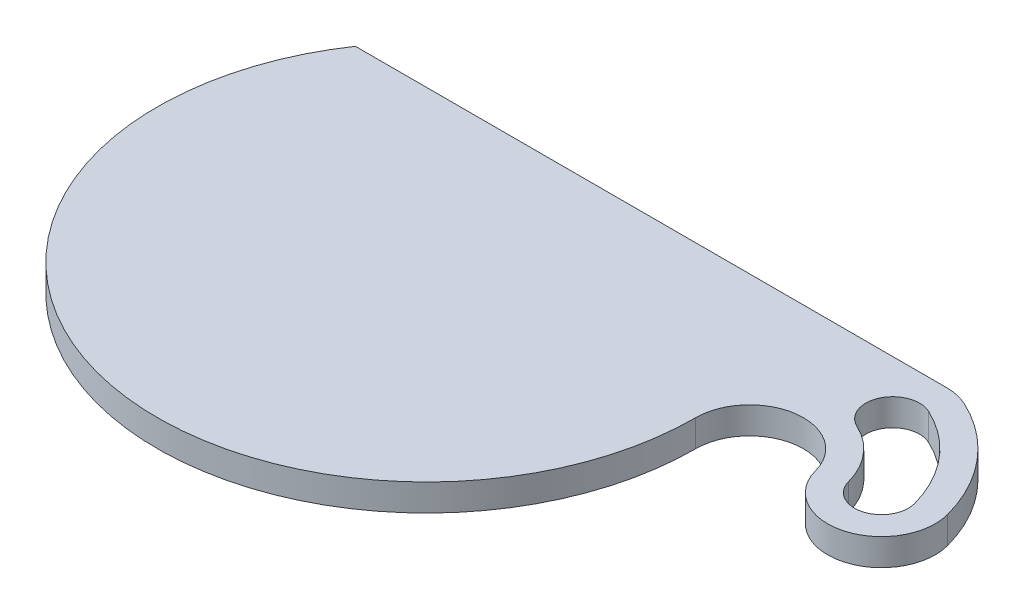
ISO-10303-21;
HEADER;
FILE_DESCRIPTION(('STEP AP214'),'2;1');
FILE_NAME('part.step','',(''),(''),'','','');
FILE_SCHEMA(('AUTOMOTIVE_DESIGN { 1 0 10303 214 1 1 1 1 }'));
ENDSEC;
DATA;
#1=APPLICATION_CONTEXT('core data for automotive mechanical design processes');
#2=APPLICATION_PROTOCOL_DEFINITION('international standard','automotive_design',2000,#1);
#3=PRODUCT_CONTEXT('',#1,'mechanical');
#4=PRODUCT('Part','Part','',(#3));
#5=PRODUCT_RELATED_PRODUCT_CATEGORY('part','',(#4));
#6=PRODUCT_DEFINITION_FORMATION('','',#4);
#7=PRODUCT_DEFINITION_CONTEXT('part definition',#1,'design');
#8=PRODUCT_DEFINITION('design','',#6,#7);
#9=PRODUCT_DEFINITION_SHAPE('','',#8);
#10=(LENGTH_UNIT() NAMED_UNIT(*) SI_UNIT(.MILLI.,.METRE.));
#11=(NAMED_UNIT(*) PLANE_ANGLE_UNIT() SI_UNIT($,.RADIAN.));
#12=(NAMED_UNIT(*) SI_UNIT($,.STERADIAN.) SOLID_ANGLE_UNIT());
#13=UNCERTAINTY_MEASURE_WITH_UNIT(LENGTH_MEASURE(1.E-05),#10,'distance_accuracy_value','');
#14=(GEOMETRIC_REPRESENTATION_CONTEXT(3) GLOBAL_UNCERTAINTY_ASSIGNED_CONTEXT((#13)) GLOBAL_UNIT_ASSIGNED_CONTEXT((#10,
#11,#12)) REPRESENTATION_CONTEXT('',''));
#15=CARTESIAN_POINT('',(0.,0.,0.));
#16=DIRECTION('',(0.,0.,1.));
#17=DIRECTION('',(1.,0.,0.));
#18=AXIS2_PLACEMENT_3D('',#15,#16,#17);
#19=CARTESIAN_POINT('',(68.452365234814,5.,-18.126155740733));
#20=DIRECTION('',(0.,-1.,0.));
#21=DIRECTION('',(0.,0.,-1.));
#22=AXIS2_PLACEMENT_3D('',#19,#20,#21);
#23=CYLINDRICAL_SURFACE('',#22,5.00000000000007);
#24=CARTESIAN_POINT('',(68.452365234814,0.,-18.126155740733));
#25=DIRECTION('',(0.,1.,0.));
#26=DIRECTION('',(0.,0.,1.));
#27=AXIS2_PLACEMENT_3D('',#24,#25,#26);
#28=CIRCLE('',#27,5.00000000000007);
#29=CARTESIAN_POINT('',(70.5654565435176,0.,-22.6576946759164));
#30=VERTEX_POINT('',#29);
#31=CARTESIAN_POINT('',(66.3392739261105,0.,-13.5946168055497));
#32=VERTEX_POINT('',#31);
#33=EDGE_CURVE('E157',#30,#32,#28,.T.);
#34=ORIENTED_EDGE('',*,*,#33,.F.);
#35=DIRECTION('',(0.,-1.,0.));
#36=VECTOR('',#35,1.);
#37=CARTESIAN_POINT('',(70.5654565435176,5.,-22.6576946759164));
#38=LINE('',#37,#36);
#39=CARTESIAN_POINT('',(70.5654565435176,5.,-22.6576946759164));
#40=VERTEX_POINT('',#39);
#41=EDGE_CURVE('E11',#40,#30,#38,.T.);
#42=ORIENTED_EDGE('',*,*,#41,.F.);
#43=CARTESIAN_POINT('',(68.452365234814,5.,-18.126155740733));
#44=DIRECTION('',(0.,1.,0.));
#45=DIRECTION('',(0.,0.,1.));
#46=AXIS2_PLACEMENT_3D('',#43,#44,#45);
#47=CIRCLE('',#46,5.00000000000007);
#48=CARTESIAN_POINT('',(66.3392739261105,5.,-13.5946168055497));
#49=VERTEX_POINT('',#48);
#50=EDGE_CURVE('E136',#40,#49,#47,.T.);
#51=ORIENTED_EDGE('',*,*,#50,.T.);
#52=DIRECTION('',(0.,-1.,0.));
#53=VECTOR('',#52,1.);
#54=CARTESIAN_POINT('',(66.3392739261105,5.,-13.5946168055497));
#55=LINE('',#54,#53);
#56=EDGE_CURVE('E94',#49,#32,#55,.T.);
#57=ORIENTED_EDGE('',*,*,#56,.T.);
#58=EDGE_LOOP('',(#34,#42,#51,#57));
#59=FACE_BOUND('',#58,.T.);
#60=ADVANCED_FACE('F35',(#59),#23,.F.);
#61=CARTESIAN_POINT('',(60.,5.,0.));
#62=DIRECTION('',(0.,-1.,0.));
#63=DIRECTION('',(0.,0.,-1.));
#64=AXIS2_PLACEMENT_3D('',#61,#62,#63);
#65=CYLINDRICAL_SURFACE('',#64,25.0000000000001);
#66=CARTESIAN_POINT('',(60.,0.,0.));
#67=DIRECTION('',(0.,1.,0.));
#68=DIRECTION('',(0.,0.,1.));
#69=AXIS2_PLACEMENT_3D('',#66,#67,#68);
#70=CIRCLE('',#69,25.0000000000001);
#71=CARTESIAN_POINT('',(84.148145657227,0.,-6.47047612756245));
#72=VERTEX_POINT('',#71);
#73=EDGE_CURVE('E128',#72,#30,#70,.T.);
#74=ORIENTED_EDGE('',*,*,#73,.F.);
#75=DIRECTION('',(0.,-1.,0.));
#76=VECTOR('',#75,1.);
#77=CARTESIAN_POINT('',(84.148145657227,5.,-6.47047612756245));
#78=LINE('',#77,#76);
#79=CARTESIAN_POINT('',(84.148145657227,5.,-6.47047612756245));
#80=VERTEX_POINT('',#79);
#81=EDGE_CURVE('E45',#80,#72,#78,.T.);
#82=ORIENTED_EDGE('',*,*,#81,.F.);
#83=CARTESIAN_POINT('',(60.,5.,0.));
#84=DIRECTION('',(0.,1.,0.));
#85=DIRECTION('',(0.,0.,1.));
#86=AXIS2_PLACEMENT_3D('',#83,#84,#85);
#87=CIRCLE('',#86,25.0000000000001);
#88=EDGE_CURVE('E126',#80,#40,#87,.T.);
#89=ORIENTED_EDGE('',*,*,#88,.T.);
#90=ORIENTED_EDGE('',*,*,#41,.T.);
#91=EDGE_LOOP('',(#74,#82,#89,#90));
#92=FACE_BOUND('',#91,.T.);
#93=ADVANCED_FACE('F125',(#92),#65,.F.);
#94=CARTESIAN_POINT('',(79.3185165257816,5.,-5.17638090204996));
#95=DIRECTION('',(0.,-1.,0.));
#96=DIRECTION('',(0.,0.,-1.));
#97=AXIS2_PLACEMENT_3D('',#94,#95,#96);
#98=CYLINDRICAL_SURFACE('',#97,5.00000000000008);
#99=CARTESIAN_POINT('',(79.3185165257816,0.,-5.17638090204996));
#100=DIRECTION('',(0.,1.,0.));
#101=DIRECTION('',(0.,0.,1.));
#102=AXIS2_PLACEMENT_3D('',#99,#100,#101);
#103=CIRCLE('',#102,5.00000000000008);
#104=CARTESIAN_POINT('',(74.4888873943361,0.,-3.88228567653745));
#105=VERTEX_POINT('',#104);
#106=EDGE_CURVE('E161',#105,#72,#103,.T.);
#107=ORIENTED_EDGE('',*,*,#106,.F.);
#108=DIRECTION('',(0.,-1.,0.));
#109=VECTOR('',#108,1.);
#110=CARTESIAN_POINT('',(74.4888873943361,5.,-3.88228567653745));
#111=LINE('',#110,#109);
#112=CARTESIAN_POINT('',(74.4888873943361,5.,-3.88228567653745));
#113=VERTEX_POINT('',#112);
#114=EDGE_CURVE('E87',#113,#105,#111,.T.);
#115=ORIENTED_EDGE('',*,*,#114,.F.);
#116=CARTESIAN_POINT('',(79.3185165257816,5.,-5.17638090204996));
#117=DIRECTION('',(0.,1.,0.));
#118=DIRECTION('',(0.,0.,1.));
#119=AXIS2_PLACEMENT_3D('',#116,#117,#118);
#120=CIRCLE('',#119,5.00000000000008);
#121=EDGE_CURVE('E135',#113,#80,#120,.T.);
#122=ORIENTED_EDGE('',*,*,#121,.T.);
#123=ORIENTED_EDGE('',*,*,#81,.T.);
#124=EDGE_LOOP('',(#107,#115,#122,#123));
#125=FACE_BOUND('',#124,.T.);
#126=ADVANCED_FACE('F138',(#125),#98,.F.);
#127=CARTESIAN_POINT('',(60.,5.,0.));
#128=DIRECTION('',(0.,-1.,0.));
#129=DIRECTION('',(0.,0.,-1.));
#130=AXIS2_PLACEMENT_3D('',#127,#128,#129);
#131=CYLINDRICAL_SURFACE('',#130,9.99999999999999);
#132=CARTESIAN_POINT('',(60.,0.,0.));
#133=DIRECTION('',(0.,1.,0.));
#134=DIRECTION('',(0.,0.,1.));
#135=AXIS2_PLACEMENT_3D('',#132,#133,#134);
#136=CIRCLE('',#135,9.99999999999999);
#137=CARTESIAN_POINT('',(50.,0.,0.));
#138=VERTEX_POINT('',#137);
#139=CARTESIAN_POINT('',(69.6592582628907,0.,-2.58819045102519));
#140=VERTEX_POINT('',#139);
#141=EDGE_CURVE('E144',#138,#140,#136,.F.);
#142=ORIENTED_EDGE('',*,*,#141,.T.);
#143=DIRECTION('',(0.,-1.,0.));
#144=VECTOR('',#143,1.);
#145=CARTESIAN_POINT('',(69.6592582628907,5.,-2.58819045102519));
#146=LINE('',#145,#144);
#147=CARTESIAN_POINT('',(69.6592582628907,5.,-2.58819045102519));
#148=VERTEX_POINT('',#147);
#149=EDGE_CURVE('E39',#148,#140,#146,.T.);
#150=ORIENTED_EDGE('',*,*,#149,.F.);
#151=CARTESIAN_POINT('',(60.,5.,0.));
#152=DIRECTION('',(0.,1.,0.));
#153=DIRECTION('',(0.,0.,1.));
#154=AXIS2_PLACEMENT_3D('',#151,#152,#153);
#155=CIRCLE('',#154,9.99999999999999);
#156=CARTESIAN_POINT('',(50.,5.,0.));
#157=VERTEX_POINT('',#156);
#158=EDGE_CURVE('E165',#157,#148,#155,.F.);
#159=ORIENTED_EDGE('',*,*,#158,.F.);
#160=DIRECTION('',(0.,-1.,0.));
#161=VECTOR('',#160,1.);
#162=CARTESIAN_POINT('',(50.,5.,0.));
#163=LINE('',#162,#161);
#164=EDGE_CURVE('E140',#157,#138,#163,.T.);
#165=ORIENTED_EDGE('',*,*,#164,.T.);
#166=EDGE_LOOP('',(#142,#150,#159,#165));
#167=FACE_BOUND('',#166,.T.);
#168=ADVANCED_FACE('F37',(#167),#131,.F.);
#169=CARTESIAN_POINT('',(79.3185165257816,5.,-5.17638090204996));
#170=DIRECTION('',(0.,-1.,0.));
#171=DIRECTION('',(0.,0.,-1.));
#172=AXIS2_PLACEMENT_3D('',#169,#170,#171);
#173=CYLINDRICAL_SURFACE('',#172,10.0000000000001);
#174=CARTESIAN_POINT('',(79.3185165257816,0.,-5.17638090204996));
#175=DIRECTION('',(0.,1.,0.));
#176=DIRECTION('',(0.,0.,1.));
#177=AXIS2_PLACEMENT_3D('',#174,#175,#176);
#178=CIRCLE('',#177,10.0000000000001);
#179=CARTESIAN_POINT('',(88.9777747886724,0.,-7.76457135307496));
#180=VERTEX_POINT('',#179);
#181=EDGE_CURVE('E147',#140,#180,#178,.T.);
#182=ORIENTED_EDGE('',*,*,#181,.T.);
#183=DIRECTION('',(0.,-1.,0.));
#184=VECTOR('',#183,1.);
#185=CARTESIAN_POINT('',(88.9777747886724,5.,-7.76457135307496));
#186=LINE('',#185,#184);
#187=CARTESIAN_POINT('',(88.9777747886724,5.,-7.76457135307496));
#188=VERTEX_POINT('',#187);
#189=EDGE_CURVE('E178',#188,#180,#186,.T.);
#190=ORIENTED_EDGE('',*,*,#189,.F.);
#191=CARTESIAN_POINT('',(79.3185165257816,5.,-5.17638090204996));
#192=DIRECTION('',(0.,1.,0.));
#193=DIRECTION('',(0.,0.,1.));
#194=AXIS2_PLACEMENT_3D('',#191,#192,#193);
#195=CIRCLE('',#194,10.0000000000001);
#196=EDGE_CURVE('E102',#148,#188,#195,.T.);
#197=ORIENTED_EDGE('',*,*,#196,.F.);
#198=ORIENTED_EDGE('',*,*,#149,.T.);
#199=EDGE_LOOP('',(#182,#190,#197,#198));
#200=FACE_BOUND('',#199,.T.);
#201=ADVANCED_FACE('F184',(#200),#173,.T.);
#202=CARTESIAN_POINT('',(60.,5.,0.));
#203=DIRECTION('',(0.,-1.,0.));
#204=DIRECTION('',(0.,0.,-1.));
#205=AXIS2_PLACEMENT_3D('',#202,#203,#204);
#206=CYLINDRICAL_SURFACE('',#205,30.0000000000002);
#207=CARTESIAN_POINT('',(60.,0.,0.));
#208=DIRECTION('',(0.,1.,0.));
#209=DIRECTION('',(0.,0.,1.));
#210=AXIS2_PLACEMENT_3D('',#207,#208,#209);
#211=CIRCLE('',#210,30.0000000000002);
#212=CARTESIAN_POINT('',(72.6785478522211,0.,-27.1892336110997));
#213=VERTEX_POINT('',#212);
#214=EDGE_CURVE('E149',#180,#213,#211,.T.);
#215=ORIENTED_EDGE('',*,*,#214,.T.);
#216=DIRECTION('',(0.,-1.,0.));
#217=VECTOR('',#216,1.);
#218=CARTESIAN_POINT('',(72.6785478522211,5.,-27.1892336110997));
#219=LINE('',#218,#217);
#220=CARTESIAN_POINT('',(72.6785478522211,5.,-27.1892336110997));
#221=VERTEX_POINT('',#220);
#222=EDGE_CURVE('E176',#221,#213,#219,.T.);
#223=ORIENTED_EDGE('',*,*,#222,.F.);
#224=CARTESIAN_POINT('',(60.,5.,0.));
#225=DIRECTION('',(0.,1.,0.));
#226=DIRECTION('',(0.,0.,1.));
#227=AXIS2_PLACEMENT_3D('',#224,#225,#226);
#228=CIRCLE('',#227,30.0000000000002);
#229=EDGE_CURVE('E205',#188,#221,#228,.T.);
#230=ORIENTED_EDGE('',*,*,#229,.F.);
#231=ORIENTED_EDGE('',*,*,#189,.T.);
#232=EDGE_LOOP('',(#215,#223,#230,#231));
#233=FACE_BOUND('',#232,.T.);
#234=ADVANCED_FACE('F196',(#233),#206,.T.);
#235=CARTESIAN_POINT('',(68.452365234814,5.,-18.126155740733));
#236=DIRECTION('',(0.,-1.,0.));
#237=DIRECTION('',(0.,0.,-1.));
#238=AXIS2_PLACEMENT_3D('',#235,#236,#237);
#239=CYLINDRICAL_SURFACE('',#238,10.0000000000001);
#240=CARTESIAN_POINT('',(68.452365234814,0.,-18.126155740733));
#241=DIRECTION('',(0.,1.,0.));
#242=DIRECTION('',(0.,0.,1.));
#243=AXIS2_PLACEMENT_3D('',#240,#241,#242);
#244=CIRCLE('',#243,10.0000000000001);
#245=CARTESIAN_POINT('',(68.452365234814,0.,-28.1261557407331));
#246=VERTEX_POINT('',#245);
#247=EDGE_CURVE('E151',#213,#246,#244,.T.);
#248=ORIENTED_EDGE('',*,*,#247,.T.);
#249=DIRECTION('',(0.,-1.,0.));
#250=VECTOR('',#249,1.);
#251=CARTESIAN_POINT('',(68.452365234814,5.,-28.1261557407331));
#252=LINE('',#251,#250);
#253=CARTESIAN_POINT('',(68.452365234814,5.,-28.1261557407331));
#254=VERTEX_POINT('',#253);
#255=EDGE_CURVE('E173',#254,#246,#252,.T.);
#256=ORIENTED_EDGE('',*,*,#255,.F.);
#257=CARTESIAN_POINT('',(68.452365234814,5.,-18.126155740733));
#258=DIRECTION('',(0.,1.,0.));
#259=DIRECTION('',(0.,0.,1.));
#260=AXIS2_PLACEMENT_3D('',#257,#258,#259);
#261=CIRCLE('',#260,10.0000000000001);
#262=EDGE_CURVE('E201',#221,#254,#261,.T.);
#263=ORIENTED_EDGE('',*,*,#262,.F.);
#264=ORIENTED_EDGE('',*,*,#222,.T.);
#265=EDGE_LOOP('',(#248,#256,#263,#264));
#266=FACE_BOUND('',#265,.T.);
#267=ADVANCED_FACE('F199',(#266),#239,.T.);
#268=CARTESIAN_POINT('',(0.,5.,-28.1261557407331));
#269=DIRECTION('',(0.,0.,1.));
#270=DIRECTION('',(1.,0.,0.));
#271=AXIS2_PLACEMENT_3D('',#268,#269,#270);
#272=PLANE('',#271);
#273=DIRECTION('',(-1.,0.,0.));
#274=VECTOR('',#273,1.);
#275=CARTESIAN_POINT('',(0.,0.,-28.1261557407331));
#276=LINE('',#275,#274);
#277=CARTESIAN_POINT('',(-41.3390779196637,0.,-28.1261557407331));
#278=VERTEX_POINT('',#277);
#279=EDGE_CURVE('E153',#246,#278,#276,.T.);
#280=ORIENTED_EDGE('',*,*,#279,.T.);
#281=DIRECTION('',(0.,-1.,0.));
#282=VECTOR('',#281,1.);
#283=CARTESIAN_POINT('',(-41.3390779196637,5.,-28.1261557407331));
#284=LINE('',#283,#282);
#285=CARTESIAN_POINT('',(-41.3390779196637,5.,-28.1261557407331));
#286=VERTEX_POINT('',#285);
#287=EDGE_CURVE('E170',#286,#278,#284,.T.);
#288=ORIENTED_EDGE('',*,*,#287,.F.);
#289=DIRECTION('',(-1.,0.,0.));
#290=VECTOR('',#289,1.);
#291=CARTESIAN_POINT('',(0.,5.,-28.1261557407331));
#292=LINE('',#291,#290);
#293=EDGE_CURVE('E204',#254,#286,#292,.T.);
#294=ORIENTED_EDGE('',*,*,#293,.F.);
#295=ORIENTED_EDGE('',*,*,#255,.T.);
#296=EDGE_LOOP('',(#280,#288,#294,#295));
#297=FACE_BOUND('',#296,.T.);
#298=ADVANCED_FACE('F221',(#297),#272,.F.);
#299=CARTESIAN_POINT('',(0.,5.,0.));
#300=DIRECTION('',(0.,-1.,0.));
#301=DIRECTION('',(0.,0.,-1.));
#302=AXIS2_PLACEMENT_3D('',#299,#300,#301);
#303=CYLINDRICAL_SURFACE('',#302,50.);
#304=CARTESIAN_POINT('',(0.,0.,0.));
#305=DIRECTION('',(0.,1.,0.));
#306=DIRECTION('',(0.,0.,1.));
#307=AXIS2_PLACEMENT_3D('',#304,#305,#306);
#308=CIRCLE('',#307,50.);
#309=EDGE_CURVE('E155',#278,#138,#308,.T.);
#310=ORIENTED_EDGE('',*,*,#309,.T.);
#311=ORIENTED_EDGE('',*,*,#164,.F.);
#312=CARTESIAN_POINT('',(0.,5.,0.));
#313=DIRECTION('',(0.,1.,0.));
#314=DIRECTION('',(0.,0.,1.));
#315=AXIS2_PLACEMENT_3D('',#312,#313,#314);
#316=CIRCLE('',#315,50.);
#317=EDGE_CURVE('E207',#286,#157,#316,.T.);
#318=ORIENTED_EDGE('',*,*,#317,.F.);
#319=ORIENTED_EDGE('',*,*,#287,.T.);
#320=EDGE_LOOP('',(#310,#311,#318,#319));
#321=FACE_BOUND('',#320,.T.);
#322=ADVANCED_FACE('F214',(#321),#303,.T.);
#323=CARTESIAN_POINT('',(60.,5.,0.));
#324=DIRECTION('',(0.,-1.,0.));
#325=DIRECTION('',(0.,0.,-1.));
#326=AXIS2_PLACEMENT_3D('',#323,#324,#325);
#327=CYLINDRICAL_SURFACE('',#326,15.);
#328=CARTESIAN_POINT('',(60.,0.,0.));
#329=DIRECTION('',(0.,1.,0.));
#330=DIRECTION('',(0.,0.,1.));
#331=AXIS2_PLACEMENT_3D('',#328,#329,#330);
#332=CIRCLE('',#331,15.);
#333=EDGE_CURVE('E163',#105,#32,#332,.T.);
#334=ORIENTED_EDGE('',*,*,#333,.T.);
#335=ORIENTED_EDGE('',*,*,#56,.F.);
#336=CARTESIAN_POINT('',(60.,5.,0.));
#337=DIRECTION('',(0.,1.,0.));
#338=DIRECTION('',(0.,0.,1.));
#339=AXIS2_PLACEMENT_3D('',#336,#337,#338);
#340=CIRCLE('',#339,15.);
#341=EDGE_CURVE('E54',#113,#49,#340,.T.);
#342=ORIENTED_EDGE('',*,*,#341,.F.);
#343=ORIENTED_EDGE('',*,*,#114,.T.);
#344=EDGE_LOOP('',(#334,#335,#342,#343));
#345=FACE_BOUND('',#344,.T.);
#346=ADVANCED_FACE('F212',(#345),#327,.T.);
#347=CARTESIAN_POINT('',(0.,5.,0.));
#348=DIRECTION('',(0.,1.,0.));
#349=DIRECTION('',(0.,0.,1.));
#350=AXIS2_PLACEMENT_3D('',#347,#348,#349);
#351=PLANE('',#350);
#352=ORIENTED_EDGE('',*,*,#158,.T.);
#353=ORIENTED_EDGE('',*,*,#196,.T.);
#354=ORIENTED_EDGE('',*,*,#229,.T.);
#355=ORIENTED_EDGE('',*,*,#262,.T.);
#356=ORIENTED_EDGE('',*,*,#293,.T.);
#357=ORIENTED_EDGE('',*,*,#317,.T.);
#358=EDGE_LOOP('',(#352,#353,#354,#355,#356,#357));
#359=FACE_BOUND('',#358,.T.);
#360=ORIENTED_EDGE('',*,*,#50,.F.);
#361=ORIENTED_EDGE('',*,*,#88,.F.);
#362=ORIENTED_EDGE('',*,*,#121,.F.);
#363=ORIENTED_EDGE('',*,*,#341,.T.);
#364=EDGE_LOOP('',(#360,#361,#362,#363));
#365=FACE_BOUND('',#364,.T.);
#366=ADVANCED_FACE('F134',(#359,#365),#351,.T.);
#367=CARTESIAN_POINT('',(0.,0.,0.));
#368=DIRECTION('',(0.,1.,0.));
#369=DIRECTION('',(0.,0.,1.));
#370=AXIS2_PLACEMENT_3D('',#367,#368,#369);
#371=PLANE('',#370);
#372=ORIENTED_EDGE('',*,*,#141,.F.);
#373=ORIENTED_EDGE('',*,*,#309,.F.);
#374=ORIENTED_EDGE('',*,*,#279,.F.);
#375=ORIENTED_EDGE('',*,*,#247,.F.);
#376=ORIENTED_EDGE('',*,*,#214,.F.);
#377=ORIENTED_EDGE('',*,*,#181,.F.);
#378=EDGE_LOOP('',(#372,#373,#374,#375,#376,#377));
#379=FACE_BOUND('',#378,.T.);
#380=ORIENTED_EDGE('',*,*,#33,.T.);
#381=ORIENTED_EDGE('',*,*,#333,.F.);
#382=ORIENTED_EDGE('',*,*,#106,.T.);
#383=ORIENTED_EDGE('',*,*,#73,.T.);
#384=EDGE_LOOP('',(#380,#381,#382,#383));
#385=FACE_BOUND('',#384,.T.);
#386=ADVANCED_FACE('F191',(#379,#385),#371,.F.);
#387=CLOSED_SHELL('',(#60,#93,#126,#168,#201,#234,#267,#298,#322,#346,#366,#386));
#388=MANIFOLD_SOLID_BREP('B2',#387);
#389=ADVANCED_BREP_SHAPE_REPRESENTATION('',(#18,#388),#14);
#390=SHAPE_DEFINITION_REPRESENTATION(#9,#389);
ENDSEC;
END-ISO-10303-21;
